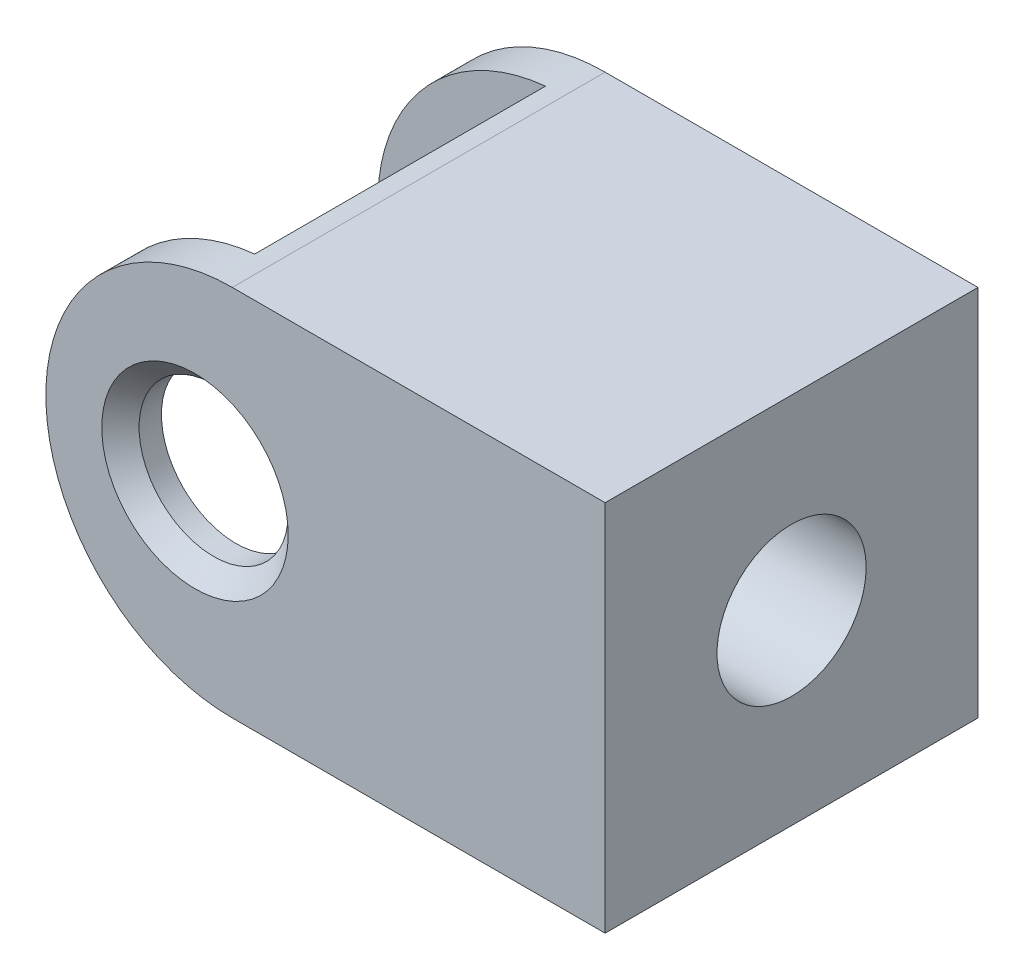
from build123d import *

# Parameters (mm, degrees)
Y_KSEKLIK_EKSTR_ZYON1_DEPTH = 20
KES_EKSTR_ZYON1_DEPTH       = 7.8
KES_EKSTR_ZYON1_DEPTH_BACK  = 7.8
IZIM2_R                     = 10
IZIM3_R                     = 4
KES_EKSTR_ZYON2_DEPTH       = 35.8
IZIM4_R                     = 4
KES_EKSTR_ZYON3_DEPTH       = 8
PAH1_SIZE                   = 1


with BuildPart() as part:
    # izim1 → Y_kseklik-Ekstr_zyon1 (new body)
    with BuildSketch(Plane.XY):
        with BuildLine():
            Line((0, 10), (20, 10))
            Line((20, 10), (20, -10))
            Line((20, -10), (0, -10))
            ThreePointArc((0, -10), (-10, 0), (0, 10))
        make_face()
    extrude(amount=Y_KSEKLIK_EKSTR_ZYON1_DEPTH)

    # izim2 → Kes-Ekstr_zyon1 (cut, two sides: drawn at the far end of the back side and taken through both)
    with BuildSketch(Plane.XY.offset(10).offset(-KES_EKSTR_ZYON1_DEPTH_BACK)):
        with Locations((-2, 0)):
            Circle(IZIM2_R)
    extrude(amount=KES_EKSTR_ZYON1_DEPTH + KES_EKSTR_ZYON1_DEPTH_BACK, mode=Mode.SUBTRACT)

    # izim3 → Kes-Ekstr_zyon2 (cut)
    with BuildSketch(Plane.XY.offset(20)):
        with Locations((-2, 0)):
            Circle(IZIM3_R)
    extrude(amount=-KES_EKSTR_ZYON2_DEPTH, mode=Mode.SUBTRACT)

    # izim4 → Kes-Ekstr_zyon3 (cut)
    with BuildSketch(Plane(origin=(20, 0, 0), x_dir=(0, 0, -1), z_dir=(1, 0, 0))):
        with Locations((-10, 0)):
            Circle(IZIM4_R)
    extrude(amount=-KES_EKSTR_ZYON3_DEPTH, mode=Mode.SUBTRACT)

    # Pah1
    pah1_edges = [part.edges().sort_by_distance(p)[0] for p in [
        (-6, 0, 0),
        (-6, 0, 20),
    ]]
    chamfer(pah1_edges, length=PAH1_SIZE)


solid = part.part
